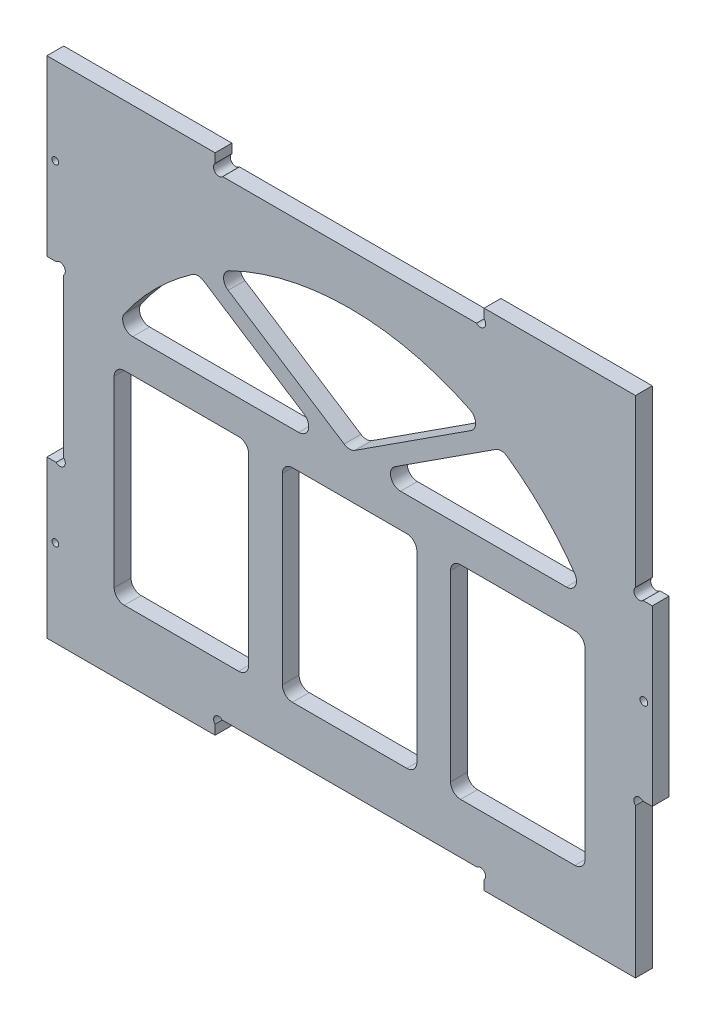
from build123d import *

# Parameters (mm, degrees)
BOSS_EXTRU_1_DEPTH      = 5
ESQUISSE2_W             = 5
ESQUISSE2_H             = 51.666666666
ESQUISSE2_H_2           = 51.666666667
ESQUISSE2_W_2           = 80
ESQUISSE2_H_3           = 5
ENL_V_MAT_EXTRU_1_DEPTH = 232.192560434
ESQUISSE3_R             = 1.6
ENL_V_MAT_EXTRU_2_DEPTH = 232.192560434
ESQUISSE5_R             = 1.15
ENL_V_MAT_EXTRU_3_DEPTH = 232.192560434
ESQUISSE6_R             = 1
ENL_V_MAT_EXTRU_4_DEPTH = 10
ESQUISSE7_W             = 40
ESQUISSE7_H             = 60.421883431
ENL_V_MAT_EXTRU_8_DEPTH = 10
CONG_1_R                = 3
CONG_2_R                = 3


with BuildPart() as part:
    # Esquisse1 → Boss.-Extru.1 (new body)
    with BuildSketch(Plane.XY):
        with BuildLine():
            Line((52.121320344, 0), (127.878679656, 0))
            ThreePointArc((127.878679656, 0), (130, 0), (130, -2.121320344))
            Line((130, -2.121320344), (130, -5))
            Line((130, -5), (175, -5))
            Line((175, -5), (175, 0))
            Line((175, 0), (180, 0))
            Line((180, 0), (180, 145))
            Line((180, 145), (0, 145))
            Line((0, 145), (0, 0))
            Line((0, 0), (0, -5))
            Line((0, -5), (50, -5))
            Line((50, -5), (50, -2.121320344))
            ThreePointArc((50, -2.121320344), (50, 0), (52.121320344, 0))
        make_face()
    extrude(amount=BOSS_EXTRU_1_DEPTH)

    # Esquisse2 → Enl_v. mat.-Extru.1 (cut, through all)
    with BuildSketch(Plane.XY.offset(5)):
        with Locations((2.5, 67.5)):
            Rectangle(ESQUISSE2_W, ESQUISSE2_H)
        with Locations((177.5, 119.166666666)):
            Rectangle(ESQUISSE2_W, ESQUISSE2_H_2)
        with Locations((177.5, 15.833333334)):
            Rectangle(ESQUISSE2_W, ESQUISSE2_H_2)
        with Locations((90, 142.5)):
            Rectangle(ESQUISSE2_W_2, ESQUISSE2_H_3)
    extrude(amount=-ENL_V_MAT_EXTRU_1_DEPTH, mode=Mode.SUBTRACT)

    # Esquisse3 → Enl_v. mat.-Extru.2 (cut, through all)
    with BuildSketch(Plane.XY.offset(5)):
        with Locations((51.13137085, 141.13137085)):
            Circle(ESQUISSE3_R)
        with Locations((128.86862915, 141.13137085)):
            Circle(ESQUISSE3_R)
        with Locations((3.86862915, 92.201962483)):
            Circle(ESQUISSE3_R)
        with Locations((3.86862915, 42.798037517)):
            Circle(ESQUISSE3_R)
        with Locations((176.13137085, 94.464704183)):
            Circle(ESQUISSE3_R)
        with Locations((176.13137085, 40.535295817)):
            Circle(ESQUISSE3_R)
    extrude(amount=-ENL_V_MAT_EXTRU_2_DEPTH, mode=Mode.SUBTRACT)

    # Esquisse5 → Enl_v. mat.-Extru.3 (cut, through all)
    with BuildSketch(Plane.XY.offset(5)):
        with Locations((177.5, 67.5)):
            Circle(ESQUISSE5_R)
    extrude(amount=-ENL_V_MAT_EXTRU_3_DEPTH, mode=Mode.SUBTRACT)

    # Esquisse6 → Enl_v. mat.-Extru.4 (cut)
    with BuildSketch(Plane.XY.offset(5)):
        with Locations((2.5, 20.833333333)):
            Circle(ESQUISSE6_R)
        with Locations((2.5, 119.166666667)):
            Circle(ESQUISSE6_R)
    extrude(amount=-ENL_V_MAT_EXTRU_4_DEPTH, mode=Mode.SUBTRACT)

    # Esquisse7 → Enl_v. mat.-Extru.8 (cut)
    with BuildSketch(Plane.XY.offset(5)):
        with BuildLine():
            ThreePointArc((44.884008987, 111.411810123), (30.993289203, 99.80391665), (20, 85.421883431))
            Line((20, 85.421883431), (85, 85.421883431))
            Line((85, 85.421883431), (44.884008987, 111.411810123))
        make_face()
        with BuildLine():
            ThreePointArc((49.602567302, 114.312431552), (90, 125), (130.397432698, 114.312431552))
            Line((130.397432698, 114.312431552), (90, 88.140167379))
            Line((90, 88.140167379), (49.602567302, 114.312431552))
        make_face()
        with BuildLine():
            Line((135.115991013, 111.411810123), (95, 85.421883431))
            Line((95, 85.421883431), (160, 85.421883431))
            ThreePointArc((160, 85.421883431), (149.006710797, 99.80391665), (135.115991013, 111.411810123))
        make_face()
        with Locations((140, 45.210941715)):
            Rectangle(ESQUISSE7_W, ESQUISSE7_H)
        with Locations((90, 45.210941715)):
            Rectangle(ESQUISSE7_W, ESQUISSE7_H)
        with Locations((40, 45.210941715)):
            Rectangle(ESQUISSE7_W, ESQUISSE7_H)
    extrude(amount=-ENL_V_MAT_EXTRU_8_DEPTH, mode=Mode.SUBTRACT)

    # Cong_1
    cong_1_edges = [part.edges().sort_by_distance(p)[0] for p in [
        (20, 85.421883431, 2.5),
        (44.884008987, 111.411810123, 2.5),
        (85, 85.421883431, 2.5),
        (49.602567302, 114.312431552, 2.5),
        (130.397432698, 114.312431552, 2.5),
        (90, 88.140167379, 2.5),
        (135.115991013, 111.411810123, 2.5),
        (160, 85.421883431, 2.5),
        (95, 85.421883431, 2.5),
    ]]
    fillet(cong_1_edges, radius=CONG_1_R)

    # Cong_2
    cong_2_edges = [part.edges().sort_by_distance(p)[0] for p in [
        (160, 15, 2.5),
        (120, 15, 2.5),
        (120, 75.421883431, 2.5),
        (160, 75.421883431, 2.5),
        (110, 75.421883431, 2.5),
        (110, 15, 2.5),
        (70, 15, 2.5),
        (70, 75.421883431, 2.5),
        (60, 15, 2.5),
        (20, 15, 2.5),
        (20, 75.421883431, 2.5),
        (60, 75.421883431, 2.5),
    ]]
    fillet(cong_2_edges, radius=CONG_2_R)


solid = part.part
